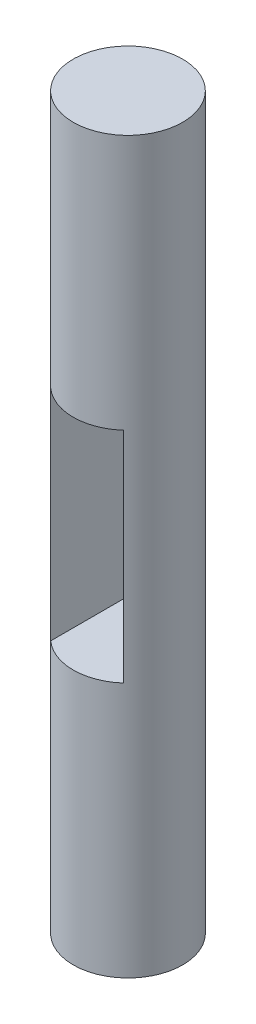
ISO-10303-21;
HEADER;
FILE_DESCRIPTION(('STEP AP214'),'2;1');
FILE_NAME('part.step','',(''),(''),'','','');
FILE_SCHEMA(('AUTOMOTIVE_DESIGN { 1 0 10303 214 1 1 1 1 }'));
ENDSEC;
DATA;
#1=APPLICATION_CONTEXT('core data for automotive mechanical design processes');
#2=APPLICATION_PROTOCOL_DEFINITION('international standard','automotive_design',2000,#1);
#3=PRODUCT_CONTEXT('',#1,'mechanical');
#4=PRODUCT('Part','Part','',(#3));
#5=PRODUCT_RELATED_PRODUCT_CATEGORY('part','',(#4));
#6=PRODUCT_DEFINITION_FORMATION('','',#4);
#7=PRODUCT_DEFINITION_CONTEXT('part definition',#1,'design');
#8=PRODUCT_DEFINITION('design','',#6,#7);
#9=PRODUCT_DEFINITION_SHAPE('','',#8);
#10=(LENGTH_UNIT() NAMED_UNIT(*) SI_UNIT(.MILLI.,.METRE.));
#11=(NAMED_UNIT(*) PLANE_ANGLE_UNIT() SI_UNIT($,.RADIAN.));
#12=(NAMED_UNIT(*) SI_UNIT($,.STERADIAN.) SOLID_ANGLE_UNIT());
#13=UNCERTAINTY_MEASURE_WITH_UNIT(LENGTH_MEASURE(1.E-05),#10,'distance_accuracy_value','');
#14=(GEOMETRIC_REPRESENTATION_CONTEXT(3) GLOBAL_UNCERTAINTY_ASSIGNED_CONTEXT((#13)) GLOBAL_UNIT_ASSIGNED_CONTEXT((#10,
#11,#12)) REPRESENTATION_CONTEXT('',''));
#15=CARTESIAN_POINT('',(0.,0.,0.));
#16=DIRECTION('',(0.,0.,1.));
#17=DIRECTION('',(1.,0.,0.));
#18=AXIS2_PLACEMENT_3D('',#15,#16,#17);
#19=CARTESIAN_POINT('',(0.,127.,0.));
#20=DIRECTION('',(0.,-1.,0.));
#21=DIRECTION('',(0.,0.,-1.));
#22=AXIS2_PLACEMENT_3D('',#19,#20,#21);
#23=CYLINDRICAL_SURFACE('',#22,9.525);
#24=DIRECTION('',(0.,-1.,0.));
#25=VECTOR('',#24,1.);
#26=CARTESIAN_POINT('',(-6.35,127.,7.09951582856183));
#27=LINE('',#26,#25);
#28=CARTESIAN_POINT('',(-6.35,44.45,7.09951582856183));
#29=VERTEX_POINT('',#28);
#30=CARTESIAN_POINT('',(-6.35,82.55,7.09951582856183));
#31=VERTEX_POINT('',#30);
#32=EDGE_CURVE('E75',#29,#31,#27,.F.);
#33=ORIENTED_EDGE('',*,*,#32,.T.);
#34=CARTESIAN_POINT('',(0.,82.55,0.));
#35=DIRECTION('',(0.,1.,0.));
#36=DIRECTION('',(0.,0.,1.));
#37=AXIS2_PLACEMENT_3D('',#34,#35,#36);
#38=CIRCLE('',#37,9.525);
#39=CARTESIAN_POINT('',(6.35,82.55,7.09951582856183));
#40=VERTEX_POINT('',#39);
#41=EDGE_CURVE('E79',#40,#31,#38,.F.);
#42=ORIENTED_EDGE('',*,*,#41,.F.);
#43=DIRECTION('',(0.,-1.,0.));
#44=VECTOR('',#43,1.);
#45=CARTESIAN_POINT('',(6.35,127.,7.09951582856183));
#46=LINE('',#45,#44);
#47=CARTESIAN_POINT('',(6.35,44.45,7.09951582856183));
#48=VERTEX_POINT('',#47);
#49=EDGE_CURVE('E55',#48,#40,#46,.F.);
#50=ORIENTED_EDGE('',*,*,#49,.F.);
#51=CARTESIAN_POINT('',(0.,44.45,0.));
#52=DIRECTION('',(0.,1.,0.));
#53=DIRECTION('',(0.,0.,1.));
#54=AXIS2_PLACEMENT_3D('',#51,#52,#53);
#55=CIRCLE('',#54,9.525);
#56=EDGE_CURVE('E98',#48,#29,#55,.F.);
#57=ORIENTED_EDGE('',*,*,#56,.T.);
#58=EDGE_LOOP('',(#33,#42,#50,#57));
#59=FACE_BOUND('',#58,.T.);
#60=CARTESIAN_POINT('',(0.,127.,0.));
#61=DIRECTION('',(0.,1.,0.));
#62=DIRECTION('',(0.,0.,1.));
#63=AXIS2_PLACEMENT_3D('',#60,#61,#62);
#64=CIRCLE('',#63,9.525);
#65=CARTESIAN_POINT('',(0.,127.,9.525));
#66=VERTEX_POINT('',#65);
#67=EDGE_CURVE('E11',#66,#66,#64,.T.);
#68=ORIENTED_EDGE('',*,*,#67,.F.);
#69=EDGE_LOOP('',(#68));
#70=FACE_BOUND('',#69,.T.);
#71=CARTESIAN_POINT('',(0.,0.,0.));
#72=DIRECTION('',(0.,1.,0.));
#73=DIRECTION('',(0.,0.,1.));
#74=AXIS2_PLACEMENT_3D('',#71,#72,#73);
#75=CIRCLE('',#74,9.525);
#76=CARTESIAN_POINT('',(0.,0.,9.525));
#77=VERTEX_POINT('',#76);
#78=EDGE_CURVE('E36',#77,#77,#75,.T.);
#79=ORIENTED_EDGE('',*,*,#78,.T.);
#80=EDGE_LOOP('',(#79));
#81=FACE_BOUND('',#80,.T.);
#82=DIRECTION('',(0.,-1.,0.));
#83=VECTOR('',#82,1.);
#84=CARTESIAN_POINT('',(-6.35,127.,-7.09951582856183));
#85=LINE('',#84,#83);
#86=CARTESIAN_POINT('',(-6.35,44.45,-7.09951582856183));
#87=VERTEX_POINT('',#86);
#88=CARTESIAN_POINT('',(-6.35,82.55,-7.09951582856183));
#89=VERTEX_POINT('',#88);
#90=EDGE_CURVE('E47',#87,#89,#85,.F.);
#91=ORIENTED_EDGE('',*,*,#90,.F.);
#92=CARTESIAN_POINT('',(0.,44.45,0.));
#93=DIRECTION('',(0.,-1.,0.));
#94=DIRECTION('',(0.,0.,-1.));
#95=AXIS2_PLACEMENT_3D('',#92,#93,#94);
#96=CIRCLE('',#95,9.525);
#97=CARTESIAN_POINT('',(6.35,44.45,-7.09951582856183));
#98=VERTEX_POINT('',#97);
#99=EDGE_CURVE('E83',#98,#87,#96,.F.);
#100=ORIENTED_EDGE('',*,*,#99,.F.);
#101=DIRECTION('',(0.,-1.,0.));
#102=VECTOR('',#101,1.);
#103=CARTESIAN_POINT('',(6.35,127.,-7.09951582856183));
#104=LINE('',#103,#102);
#105=CARTESIAN_POINT('',(6.35,82.55,-7.09951582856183));
#106=VERTEX_POINT('',#105);
#107=EDGE_CURVE('E93',#98,#106,#104,.F.);
#108=ORIENTED_EDGE('',*,*,#107,.T.);
#109=CARTESIAN_POINT('',(0.,82.55,0.));
#110=DIRECTION('',(0.,-1.,0.));
#111=DIRECTION('',(0.,0.,-1.));
#112=AXIS2_PLACEMENT_3D('',#109,#110,#111);
#113=CIRCLE('',#112,9.525);
#114=EDGE_CURVE('E91',#106,#89,#113,.F.);
#115=ORIENTED_EDGE('',*,*,#114,.T.);
#116=EDGE_LOOP('',(#91,#100,#108,#115));
#117=FACE_BOUND('',#116,.T.);
#118=ADVANCED_FACE('F33',(#59,#70,#81,#117),#23,.T.);
#119=CARTESIAN_POINT('',(0.,127.,0.));
#120=DIRECTION('',(0.,1.,0.));
#121=DIRECTION('',(0.,0.,1.));
#122=AXIS2_PLACEMENT_3D('',#119,#120,#121);
#123=PLANE('',#122);
#124=ORIENTED_EDGE('',*,*,#67,.T.);
#125=EDGE_LOOP('',(#124));
#126=FACE_BOUND('',#125,.T.);
#127=ADVANCED_FACE('F115',(#126),#123,.T.);
#128=CARTESIAN_POINT('',(0.,0.,0.));
#129=DIRECTION('',(0.,1.,0.));
#130=DIRECTION('',(0.,0.,1.));
#131=AXIS2_PLACEMENT_3D('',#128,#129,#130);
#132=PLANE('',#131);
#133=ORIENTED_EDGE('',*,*,#78,.F.);
#134=EDGE_LOOP('',(#133));
#135=FACE_BOUND('',#134,.T.);
#136=ADVANCED_FACE('F113',(#135),#132,.F.);
#137=CARTESIAN_POINT('',(-6.35,32.1207089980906,9.526));
#138=DIRECTION('',(1.,0.,0.));
#139=DIRECTION('',(0.,0.,-1.));
#140=AXIS2_PLACEMENT_3D('',#137,#138,#139);
#141=PLANE('',#140);
#142=DIRECTION('',(0.,0.,-1.));
#143=VECTOR('',#142,1.);
#144=CARTESIAN_POINT('',(-6.35,44.45,9.526));
#145=LINE('',#144,#143);
#146=EDGE_CURVE('E71',#29,#87,#145,.T.);
#147=ORIENTED_EDGE('',*,*,#146,.T.);
#148=ORIENTED_EDGE('',*,*,#90,.T.);
#149=DIRECTION('',(0.,0.,-1.));
#150=VECTOR('',#149,1.);
#151=CARTESIAN_POINT('',(-6.35,82.55,9.526));
#152=LINE('',#151,#150);
#153=EDGE_CURVE('E101',#31,#89,#152,.T.);
#154=ORIENTED_EDGE('',*,*,#153,.F.);
#155=ORIENTED_EDGE('',*,*,#32,.F.);
#156=EDGE_LOOP('',(#147,#148,#154,#155));
#157=FACE_BOUND('',#156,.T.);
#158=ADVANCED_FACE('F73',(#157),#141,.T.);
#159=CARTESIAN_POINT('',(0.,44.45,9.526));
#160=DIRECTION('',(0.,1.,0.));
#161=DIRECTION('',(0.,0.,1.));
#162=AXIS2_PLACEMENT_3D('',#159,#160,#161);
#163=PLANE('',#162);
#164=DIRECTION('',(0.,0.,-1.));
#165=VECTOR('',#164,1.);
#166=CARTESIAN_POINT('',(6.35,44.45,9.526));
#167=LINE('',#166,#165);
#168=EDGE_CURVE('E80',#48,#98,#167,.T.);
#169=ORIENTED_EDGE('',*,*,#168,.T.);
#170=ORIENTED_EDGE('',*,*,#99,.T.);
#171=ORIENTED_EDGE('',*,*,#146,.F.);
#172=ORIENTED_EDGE('',*,*,#56,.F.);
#173=EDGE_LOOP('',(#169,#170,#171,#172));
#174=FACE_BOUND('',#173,.T.);
#175=ADVANCED_FACE('F84',(#174),#163,.T.);
#176=CARTESIAN_POINT('',(6.35,32.1207089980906,9.526));
#177=DIRECTION('',(1.,0.,0.));
#178=DIRECTION('',(0.,0.,-1.));
#179=AXIS2_PLACEMENT_3D('',#176,#177,#178);
#180=PLANE('',#179);
#181=ORIENTED_EDGE('',*,*,#49,.T.);
#182=DIRECTION('',(0.,0.,-1.));
#183=VECTOR('',#182,1.);
#184=CARTESIAN_POINT('',(6.35,82.55,9.526));
#185=LINE('',#184,#183);
#186=EDGE_CURVE('E103',#40,#106,#185,.T.);
#187=ORIENTED_EDGE('',*,*,#186,.T.);
#188=ORIENTED_EDGE('',*,*,#107,.F.);
#189=ORIENTED_EDGE('',*,*,#168,.F.);
#190=EDGE_LOOP('',(#181,#187,#188,#189));
#191=FACE_BOUND('',#190,.T.);
#192=ADVANCED_FACE('F157',(#191),#180,.F.);
#193=CARTESIAN_POINT('',(0.,82.55,9.526));
#194=DIRECTION('',(0.,1.,0.));
#195=DIRECTION('',(0.,0.,1.));
#196=AXIS2_PLACEMENT_3D('',#193,#194,#195);
#197=PLANE('',#196);
#198=ORIENTED_EDGE('',*,*,#41,.T.);
#199=ORIENTED_EDGE('',*,*,#153,.T.);
#200=ORIENTED_EDGE('',*,*,#114,.F.);
#201=ORIENTED_EDGE('',*,*,#186,.F.);
#202=EDGE_LOOP('',(#198,#199,#200,#201));
#203=FACE_BOUND('',#202,.T.);
#204=ADVANCED_FACE('F165',(#203),#197,.F.);
#205=CLOSED_SHELL('',(#118,#127,#136,#158,#175,#192,#204));
#206=MANIFOLD_SOLID_BREP('B2',#205);
#207=ADVANCED_BREP_SHAPE_REPRESENTATION('',(#18,#206),#14);
#208=SHAPE_DEFINITION_REPRESENTATION(#9,#207);
ENDSEC;
END-ISO-10303-21;
